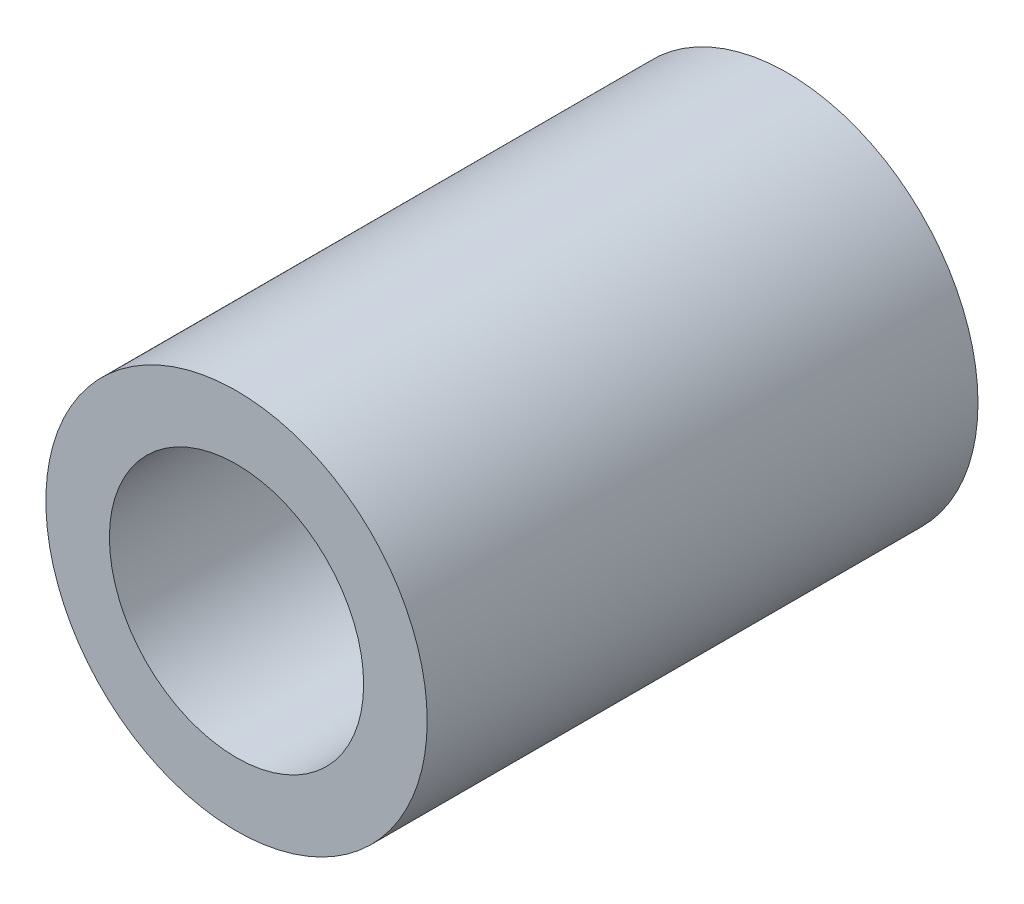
from build123d import *

# Parameters (mm, degrees)
SKETCH_1_R          = 22.5
SKETCH_1_R_2        = 15
EXTRUDE_1_DEPTH     = 32.5
SKETCH_2_R          = 4
CUT_EXTRUDE_1_DEPTH = 60


with BuildPart() as part:
    # Sketch 1 → Extrude 1 (new, symmetric)
    with BuildSketch(Plane.XY):
        Circle(SKETCH_1_R)
        Circle(SKETCH_1_R_2, mode=Mode.SUBTRACT)
    extrude(amount=EXTRUDE_1_DEPTH, both=True)

    # Sketch 2 → Cut-Extrude 1 (cut)
    with BuildSketch(Plane(origin=(0, 0, 0), x_dir=(1, 0, 0), z_dir=(0, 1, 0))):
        with Locations(Location((0, 0, 0), (0, 0, 270))):
            Circle(SKETCH_2_R)
    extrude(amount=-CUT_EXTRUDE_1_DEPTH, mode=Mode.SUBTRACT)


solid = part.part
